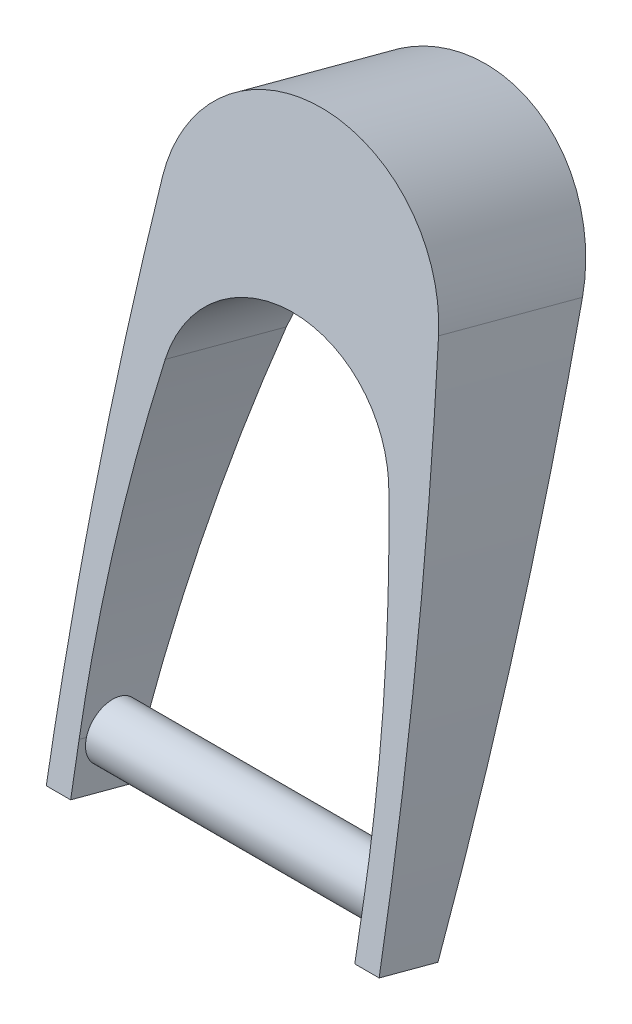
from build123d import *

# Parameters (mm, degrees)
BOSS_EXTRUDE1_DEPTH = 7.5
SKETCH3_R           = 6.685321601
BOSS_EXTRUDE2_DEPTH = 37.5
DRAFT3_ANGLE        = 5


with BuildPart() as part:
    # Sketch2 → Boss-Extrude1 (new, symmetric)
    with BuildSketch(Plane(origin=(0, 0, 0), x_dir=(1, 0, 0), z_dir=(0, 0.25881904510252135, 0.9659258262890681))):
        with BuildLine():
            Line((-35, -12.000943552), (-35, 0))
            add(Edge.make_bspline(
                [(-27.535409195, 78.831441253), (-35, 39.745459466), (-35, 0)],
                knots=[2.95917216, 2.95917216, 2.95917216, 3.141592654, 3.141592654, 3.141592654], degree=2, weights=[1, 0.995843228, 1]))
            add(Edge.make_bspline(
                [(27.535409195, 78.831441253), (23.307233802, 100.970951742), (0, 100.970951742), (-23.307233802, 100.970951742), (-27.535409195, 78.831441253)],
                knots=[0.182420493, 0.182420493, 0.182420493, 1.570796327, 1.570796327, 2.95917216, 2.95917216, 2.95917216], degree=2, weights=[1, 0.768573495, 1, 0.768573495, 1]))
            add(Edge.make_bspline(
                [(35, 0), (35, 39.745459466), (27.535409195, 78.831441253)],
                knots=[3.141592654, 3.141592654, 3.141592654, 3.324013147, 3.324013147, 3.324013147], degree=2, weights=[1, 0.995843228, 1]))
            Line((35, 0), (35, -12.000943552))
            Line((35, -12.000943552), (41, -12.000943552))
            add(Edge.make_bspline(
                [(41, -12.000943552), (41, 50.229887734), (34, 112.092305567)],
                knots=[3.141592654, 3.141592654, 3.141592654, 3.250459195, 3.250459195, 3.250459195], degree=2, weights=[1, 0.998518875, 1]))
            add(Edge.make_bspline(
                [(34, 112.092305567), (30.667884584, 141.539836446), (0, 141.539836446), (-30.667884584, 141.539836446), (-34, 112.092305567)],
                knots=[3.250459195, 3.250459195, 3.250459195, 4.71238898, 4.71238898, 6.174318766, 6.174318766, 6.174318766], degree=2, weights=[1, 0.744530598, 1, 0.744530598, 1]))
            add(Edge.make_bspline(
                [(-34, 112.092305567), (-41, 50.229887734), (-41, -12.000943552)],
                knots=[3.032726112, 3.032726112, 3.032726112, 3.141592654, 3.141592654, 3.141592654], degree=2, weights=[1, 0.998518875, 1]))
            Line((-41, -12.000943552), (-35, -12.000943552))
        make_face()
    extrude(amount=BOSS_EXTRUDE1_DEPTH, both=True)

    # Sketch3 → Boss-Extrude2 (add, symmetric)
    with BuildSketch(Plane(origin=(0, 0, 0), x_dir=(0, 0, -1), z_dir=(1, 0, 0))):
        with Locations(Location((0, 0, 0), (0, 0, 165))):
            Circle(SKETCH3_R)
    extrude(amount=BOSS_EXTRUDE2_DEPTH, both=True)

    # Draft3
    draft3_faces = [part.faces().sort_by_distance(p)[0] for p in [
        (-36.740654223, -3.85486782, 8.797480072),
        (-36.740654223, -7.737153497, -5.691407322),
    ]]
    draft(draft3_faces, Plane(origin=(-41, -9.650878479, 10.350516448), x_dir=(0, -0.25881904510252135, -0.9659258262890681), z_dir=(0, -0.9659258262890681, 0.25881904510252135)), DRAFT3_ANGLE)


solid = part.part
